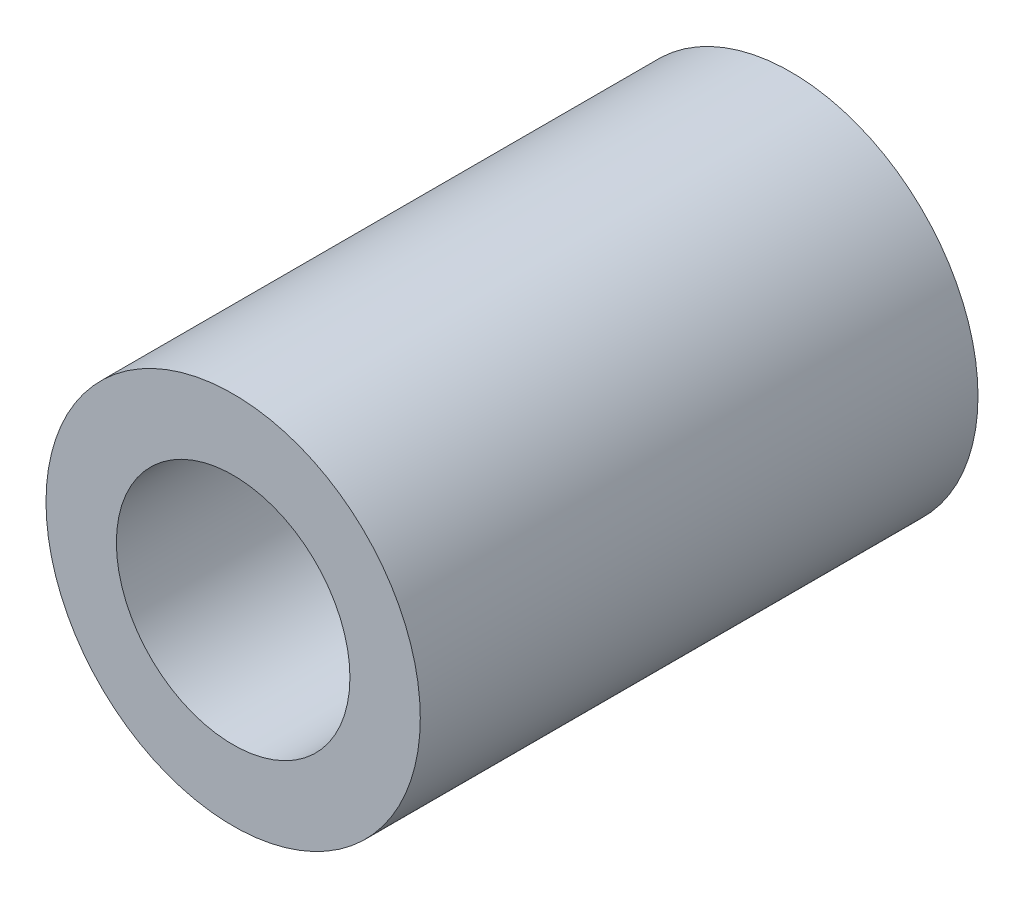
from build123d import *

# Parameters (mm, degrees)
SKETCH1_R      = 6.35
SKETCH1_R_2    = 3.9624
EXTRUDE1_DEPTH = 9.4615


with BuildPart() as part:
    # Sketch1 → Extrude1 (new, symmetric)
    with BuildSketch(Plane.XY):
        Circle(SKETCH1_R)
        Circle(SKETCH1_R_2, mode=Mode.SUBTRACT)
    extrude(amount=EXTRUDE1_DEPTH, both=True)


solid = part.part
